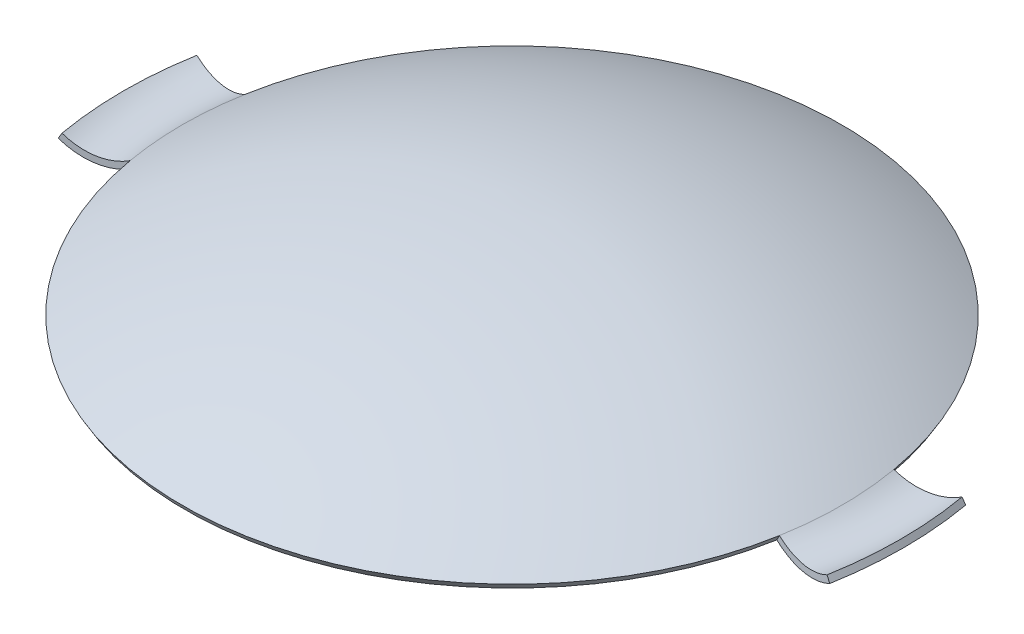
from build123d import *

# Parameters (mm, degrees)
ROTATION5_ANGLE = 20


with BuildPart() as part:
    # Skizze5 → Rotation4 (revolve)
    with BuildSketch(Plane.XY):
        with BuildLine():
            Line((-101, -25.062868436), (-100, -26.794919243))
            ThreePointArc((-100, -26.794919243), (-51.763809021, -6.814834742), (0, 0))
            Line((0, 0), (0, 2))
            ThreePointArc((0, 2), (-52.281447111, -4.88298309), (-101, -25.062868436))
        make_face()
    revolve(axis=Axis((0, 0, 0), (0, -1, 0)))

    # Skizze6 → Rotation5 (revolve, symmetric)
    with BuildSketch(Plane.XY) as rotation5_sk:
        with BuildLine():
            Line((-101, -25.062868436), (-100, -26.794919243))
            ThreePointArc((-100, -26.794919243), (-110, -29.474411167), (-120, -26.794919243))
            Line((-120, -26.794919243), (-119, -25.062868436))
            ThreePointArc((-119, -25.062868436), (-110, -27.474411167), (-101, -25.062868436))
        make_face()
    rotation5 = revolve(axis=Axis((0, -9.474411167, 0), (0, 1, 0)), revolution_arc=ROTATION5_ANGLE / 2)
    rotation5 = rotation5 + revolve(rotation5_sk.sketch, axis=Axis((0, -9.474411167, 0), (0, -1, 0)), revolution_arc=ROTATION5_ANGLE / 2)

    # Spiegeln1: Rotation5 across plane
    add(rotation5.mirror(Plane(origin=(0, 0, 0), x_dir=(0, 0, 1), z_dir=(1, 0, 0))))


solid = part.part
